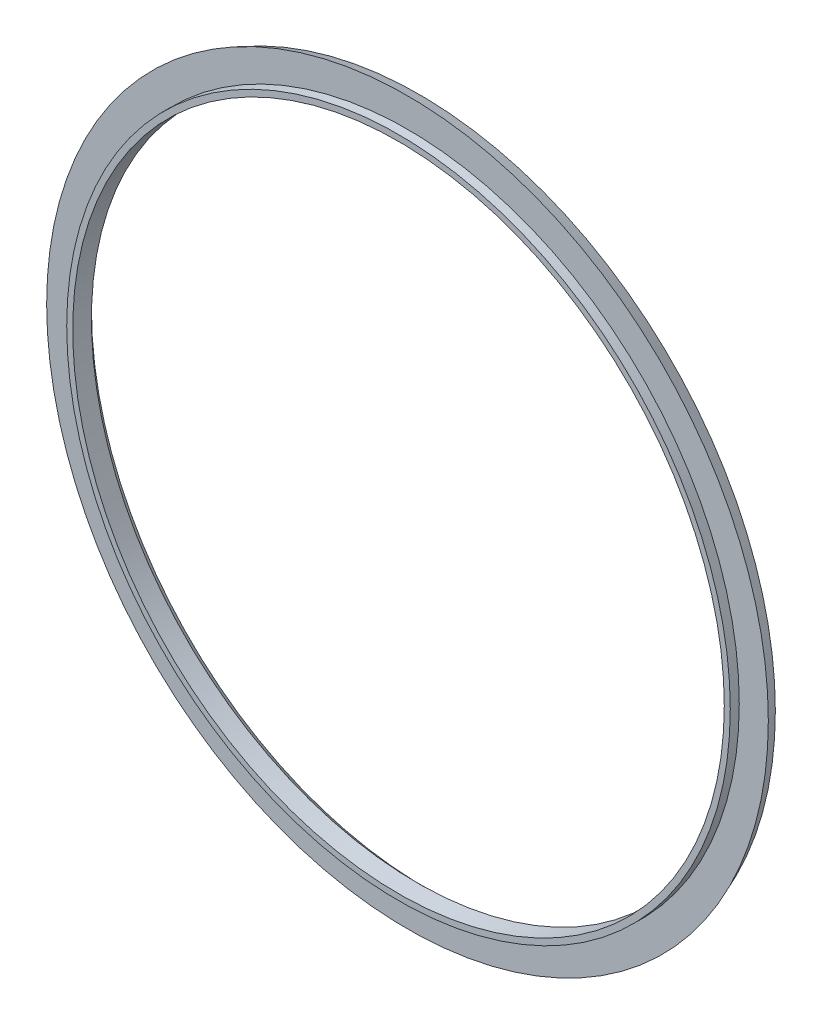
ISO-10303-21;
HEADER;
FILE_DESCRIPTION(('STEP AP214'),'2;1');
FILE_NAME('part.step','',(''),(''),'','','');
FILE_SCHEMA(('AUTOMOTIVE_DESIGN { 1 0 10303 214 1 1 1 1 }'));
ENDSEC;
DATA;
#1=APPLICATION_CONTEXT('core data for automotive mechanical design processes');
#2=APPLICATION_PROTOCOL_DEFINITION('international standard','automotive_design',2000,#1);
#3=PRODUCT_CONTEXT('',#1,'mechanical');
#4=PRODUCT('Part','Part','',(#3));
#5=PRODUCT_RELATED_PRODUCT_CATEGORY('part','',(#4));
#6=PRODUCT_DEFINITION_FORMATION('','',#4);
#7=PRODUCT_DEFINITION_CONTEXT('part definition',#1,'design');
#8=PRODUCT_DEFINITION('design','',#6,#7);
#9=PRODUCT_DEFINITION_SHAPE('','',#8);
#10=(LENGTH_UNIT() NAMED_UNIT(*) SI_UNIT(.MILLI.,.METRE.));
#11=(NAMED_UNIT(*) PLANE_ANGLE_UNIT() SI_UNIT($,.RADIAN.));
#12=(NAMED_UNIT(*) SI_UNIT($,.STERADIAN.) SOLID_ANGLE_UNIT());
#13=UNCERTAINTY_MEASURE_WITH_UNIT(LENGTH_MEASURE(1.E-05),#10,'distance_accuracy_value','');
#14=(GEOMETRIC_REPRESENTATION_CONTEXT(3) GLOBAL_UNCERTAINTY_ASSIGNED_CONTEXT((#13)) GLOBAL_UNIT_ASSIGNED_CONTEXT((#10,
#11,#12)) REPRESENTATION_CONTEXT('',''));
#15=CARTESIAN_POINT('',(0.,0.,0.));
#16=DIRECTION('',(0.,0.,1.));
#17=DIRECTION('',(1.,0.,0.));
#18=AXIS2_PLACEMENT_3D('',#15,#16,#17);
#19=CARTESIAN_POINT('',(0.,0.,-42.0333884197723));
#20=DIRECTION('',(0.,0.,1.));
#21=DIRECTION('',(1.,0.,0.));
#22=AXIS2_PLACEMENT_3D('',#19,#20,#21);
#23=CONICAL_SURFACE('',#22,94.2156178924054,0.392699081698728);
#24=CARTESIAN_POINT('',(0.,0.,-38.8583884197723));
#25=DIRECTION('',(0.,0.,1.));
#26=DIRECTION('',(1.,0.,0.));
#27=AXIS2_PLACEMENT_3D('',#24,#25,#26);
#28=CIRCLE('',#27,95.53074595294);
#29=CARTESIAN_POINT('',(95.53074595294,0.,-38.8583884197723));
#30=VERTEX_POINT('',#29);
#31=EDGE_CURVE('E10',#30,#30,#28,.T.);
#32=ORIENTED_EDGE('',*,*,#31,.F.);
#33=EDGE_LOOP('',(#32));
#34=FACE_BOUND('',#33,.T.);
#35=CARTESIAN_POINT('',(0.,0.,-42.0333884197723));
#36=DIRECTION('',(0.,0.,1.));
#37=DIRECTION('',(1.,0.,0.));
#38=AXIS2_PLACEMENT_3D('',#35,#36,#37);
#39=CIRCLE('',#38,94.2156178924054);
#40=CARTESIAN_POINT('',(94.2156178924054,0.,-42.0333884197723));
#41=VERTEX_POINT('',#40);
#42=EDGE_CURVE('E62',#41,#41,#39,.T.);
#43=ORIENTED_EDGE('',*,*,#42,.T.);
#44=EDGE_LOOP('',(#43));
#45=FACE_BOUND('',#44,.T.);
#46=ADVANCED_FACE('F31',(#34,#45),#23,.T.);
#47=CARTESIAN_POINT('',(0.,95.53074595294,-38.8583884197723));
#48=DIRECTION('',(0.,0.,-1.));
#49=DIRECTION('',(-1.,0.,0.));
#50=AXIS2_PLACEMENT_3D('',#47,#48,#49);
#51=PLANE('',#50);
#52=CARTESIAN_POINT('',(0.,0.,-38.8583884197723));
#53=DIRECTION('',(0.,0.,1.));
#54=DIRECTION('',(1.,0.,0.));
#55=AXIS2_PLACEMENT_3D('',#52,#53,#54);
#56=CIRCLE('',#55,87.8389425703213);
#57=CARTESIAN_POINT('',(87.8389425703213,0.,-38.8583884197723));
#58=VERTEX_POINT('',#57);
#59=EDGE_CURVE('E37',#58,#58,#56,.T.);
#60=ORIENTED_EDGE('',*,*,#59,.F.);
#61=EDGE_LOOP('',(#60));
#62=FACE_BOUND('',#61,.T.);
#63=ORIENTED_EDGE('',*,*,#31,.T.);
#64=EDGE_LOOP('',(#63));
#65=FACE_BOUND('',#64,.T.);
#66=ADVANCED_FACE('F79',(#62,#65),#51,.F.);
#67=CARTESIAN_POINT('',(0.,0.,0.));
#68=DIRECTION('',(0.,0.,1.));
#69=DIRECTION('',(1.,0.,0.));
#70=AXIS2_PLACEMENT_3D('',#67,#68,#69);
#71=CYLINDRICAL_SURFACE('',#70,87.8389425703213);
#72=CARTESIAN_POINT('',(0.,0.,-36.4771384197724));
#73=DIRECTION('',(0.,0.,1.));
#74=DIRECTION('',(1.,0.,0.));
#75=AXIS2_PLACEMENT_3D('',#72,#73,#74);
#76=CIRCLE('',#75,87.8389425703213);
#77=CARTESIAN_POINT('',(87.8389425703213,0.,-36.4771384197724));
#78=VERTEX_POINT('',#77);
#79=EDGE_CURVE('E41',#78,#78,#76,.T.);
#80=ORIENTED_EDGE('',*,*,#79,.F.);
#81=EDGE_LOOP('',(#80));
#82=FACE_BOUND('',#81,.T.);
#83=ORIENTED_EDGE('',*,*,#59,.T.);
#84=EDGE_LOOP('',(#83));
#85=FACE_BOUND('',#84,.T.);
#86=ADVANCED_FACE('F84',(#82,#85),#71,.T.);
#87=CARTESIAN_POINT('',(0.,87.8389425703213,-36.4771384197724));
#88=DIRECTION('',(0.,0.,-1.));
#89=DIRECTION('',(-1.,0.,0.));
#90=AXIS2_PLACEMENT_3D('',#87,#88,#89);
#91=PLANE('',#90);
#92=CARTESIAN_POINT('',(0.,0.,-36.4771384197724));
#93=DIRECTION('',(0.,0.,1.));
#94=DIRECTION('',(1.,0.,0.));
#95=AXIS2_PLACEMENT_3D('',#92,#93,#94);
#96=CIRCLE('',#95,86.2514425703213);
#97=CARTESIAN_POINT('',(86.2514425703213,0.,-36.4771384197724));
#98=VERTEX_POINT('',#97);
#99=EDGE_CURVE('E45',#98,#98,#96,.T.);
#100=ORIENTED_EDGE('',*,*,#99,.F.);
#101=EDGE_LOOP('',(#100));
#102=FACE_BOUND('',#101,.T.);
#103=ORIENTED_EDGE('',*,*,#79,.T.);
#104=EDGE_LOOP('',(#103));
#105=FACE_BOUND('',#104,.T.);
#106=ADVANCED_FACE('F89',(#102,#105),#91,.F.);
#107=CARTESIAN_POINT('',(0.,0.,0.));
#108=DIRECTION('',(0.,0.,1.));
#109=DIRECTION('',(1.,0.,0.));
#110=AXIS2_PLACEMENT_3D('',#107,#108,#109);
#111=CYLINDRICAL_SURFACE('',#110,86.2514425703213);
#112=CARTESIAN_POINT('',(0.,0.,-41.4353048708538));
#113=DIRECTION('',(0.,0.,1.));
#114=DIRECTION('',(1.,0.,0.));
#115=AXIS2_PLACEMENT_3D('',#112,#113,#114);
#116=CIRCLE('',#115,86.2514425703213);
#117=CARTESIAN_POINT('',(86.2514425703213,0.,-41.4353048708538));
#118=VERTEX_POINT('',#117);
#119=EDGE_CURVE('E50',#118,#118,#116,.T.);
#120=ORIENTED_EDGE('',*,*,#119,.F.);
#121=EDGE_LOOP('',(#120));
#122=FACE_BOUND('',#121,.T.);
#123=ORIENTED_EDGE('',*,*,#99,.T.);
#124=EDGE_LOOP('',(#123));
#125=FACE_BOUND('',#124,.T.);
#126=ADVANCED_FACE('F95',(#122,#125),#111,.F.);
#127=CARTESIAN_POINT('',(0.,0.,-43.6081884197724));
#128=DIRECTION('',(0.,0.,-1.));
#129=DIRECTION('',(-1.,0.,0.));
#130=AXIS2_PLACEMENT_3D('',#127,#128,#129);
#131=CONICAL_SURFACE('',#130,88.4243261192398,0.785398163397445);
#132=ORIENTED_EDGE('',*,*,#119,.T.);
#133=EDGE_LOOP('',(#132));
#134=FACE_BOUND('',#133,.T.);
#135=CARTESIAN_POINT('',(0.,0.,-43.6081884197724));
#136=DIRECTION('',(0.,0.,1.));
#137=DIRECTION('',(1.,0.,0.));
#138=AXIS2_PLACEMENT_3D('',#135,#136,#137);
#139=CIRCLE('',#138,88.4243261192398);
#140=CARTESIAN_POINT('',(88.4243261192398,0.,-43.6081884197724));
#141=VERTEX_POINT('',#140);
#142=EDGE_CURVE('E53',#141,#141,#139,.T.);
#143=ORIENTED_EDGE('',*,*,#142,.F.);
#144=EDGE_LOOP('',(#143));
#145=FACE_BOUND('',#144,.T.);
#146=ADVANCED_FACE('F99',(#134,#145),#131,.F.);
#147=CARTESIAN_POINT('',(0.,89.9483261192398,-43.6081884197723));
#148=DIRECTION('',(0.,0.,-1.));
#149=DIRECTION('',(-1.,0.,0.));
#150=AXIS2_PLACEMENT_3D('',#147,#148,#149);
#151=PLANE('',#150);
#152=ORIENTED_EDGE('',*,*,#142,.T.);
#153=EDGE_LOOP('',(#152));
#154=FACE_BOUND('',#153,.T.);
#155=CARTESIAN_POINT('',(0.,0.,-43.6081884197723));
#156=DIRECTION('',(0.,0.,1.));
#157=DIRECTION('',(1.,0.,0.));
#158=AXIS2_PLACEMENT_3D('',#155,#156,#157);
#159=CIRCLE('',#158,89.9483261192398);
#160=CARTESIAN_POINT('',(89.9483261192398,0.,-43.6081884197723));
#161=VERTEX_POINT('',#160);
#162=EDGE_CURVE('E56',#161,#161,#159,.T.);
#163=ORIENTED_EDGE('',*,*,#162,.F.);
#164=EDGE_LOOP('',(#163));
#165=FACE_BOUND('',#164,.T.);
#166=ADVANCED_FACE('F75',(#154,#165),#151,.T.);
#167=CARTESIAN_POINT('',(0.,0.,-42.0333884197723));
#168=DIRECTION('',(0.,0.,1.));
#169=DIRECTION('',(1.,0.,0.));
#170=AXIS2_PLACEMENT_3D('',#167,#168,#169);
#171=CONICAL_SURFACE('',#170,90.7507267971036,0.471238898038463);
#172=ORIENTED_EDGE('',*,*,#162,.T.);
#173=EDGE_LOOP('',(#172));
#174=FACE_BOUND('',#173,.T.);
#175=CARTESIAN_POINT('',(0.,0.,-42.0333884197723));
#176=DIRECTION('',(0.,0.,1.));
#177=DIRECTION('',(1.,0.,0.));
#178=AXIS2_PLACEMENT_3D('',#175,#176,#177);
#179=CIRCLE('',#178,90.7507267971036);
#180=CARTESIAN_POINT('',(90.7507267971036,0.,-42.0333884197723));
#181=VERTEX_POINT('',#180);
#182=EDGE_CURVE('E59',#181,#181,#179,.T.);
#183=ORIENTED_EDGE('',*,*,#182,.F.);
#184=EDGE_LOOP('',(#183));
#185=FACE_BOUND('',#184,.T.);
#186=ADVANCED_FACE('F69',(#174,#185),#171,.T.);
#187=CARTESIAN_POINT('',(0.,94.2156178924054,-42.0333884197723));
#188=DIRECTION('',(0.,0.,-1.));
#189=DIRECTION('',(-1.,0.,0.));
#190=AXIS2_PLACEMENT_3D('',#187,#188,#189);
#191=PLANE('',#190);
#192=ORIENTED_EDGE('',*,*,#182,.T.);
#193=EDGE_LOOP('',(#192));
#194=FACE_BOUND('',#193,.T.);
#195=ORIENTED_EDGE('',*,*,#42,.F.);
#196=EDGE_LOOP('',(#195));
#197=FACE_BOUND('',#196,.T.);
#198=ADVANCED_FACE('F67',(#194,#197),#191,.T.);
#199=CLOSED_SHELL('',(#46,#66,#86,#106,#126,#146,#166,#186,#198));
#200=MANIFOLD_SOLID_BREP('B2',#199);
#201=ADVANCED_BREP_SHAPE_REPRESENTATION('',(#18,#200),#14);
#202=SHAPE_DEFINITION_REPRESENTATION(#9,#201);
ENDSEC;
END-ISO-10303-21;
